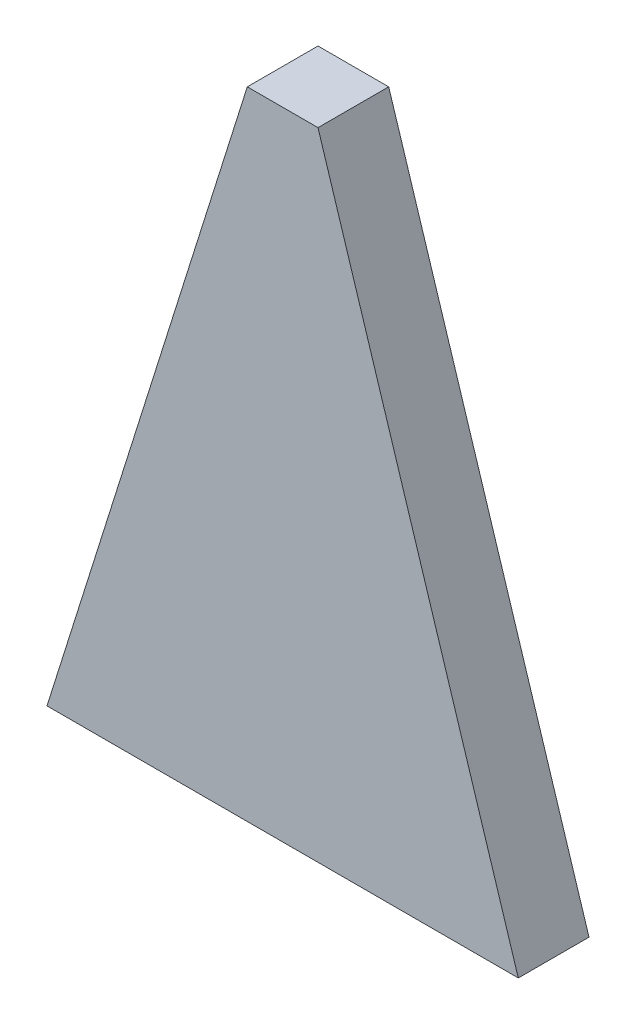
from build123d import *

# Parameters (mm, degrees)
BOSS_EXTRU_1_DEPTH = 3


with BuildPart() as part:
    # Esquisse1 → Boss.-Extru.1 (new body)
    with BuildSketch(Plane.XY):
        Polygon((1.5, 27), (-1.5, 27), (-10, 0), (0, 0), (10, 0), align=None)
    extrude(amount=BOSS_EXTRU_1_DEPTH)


solid = part.part
